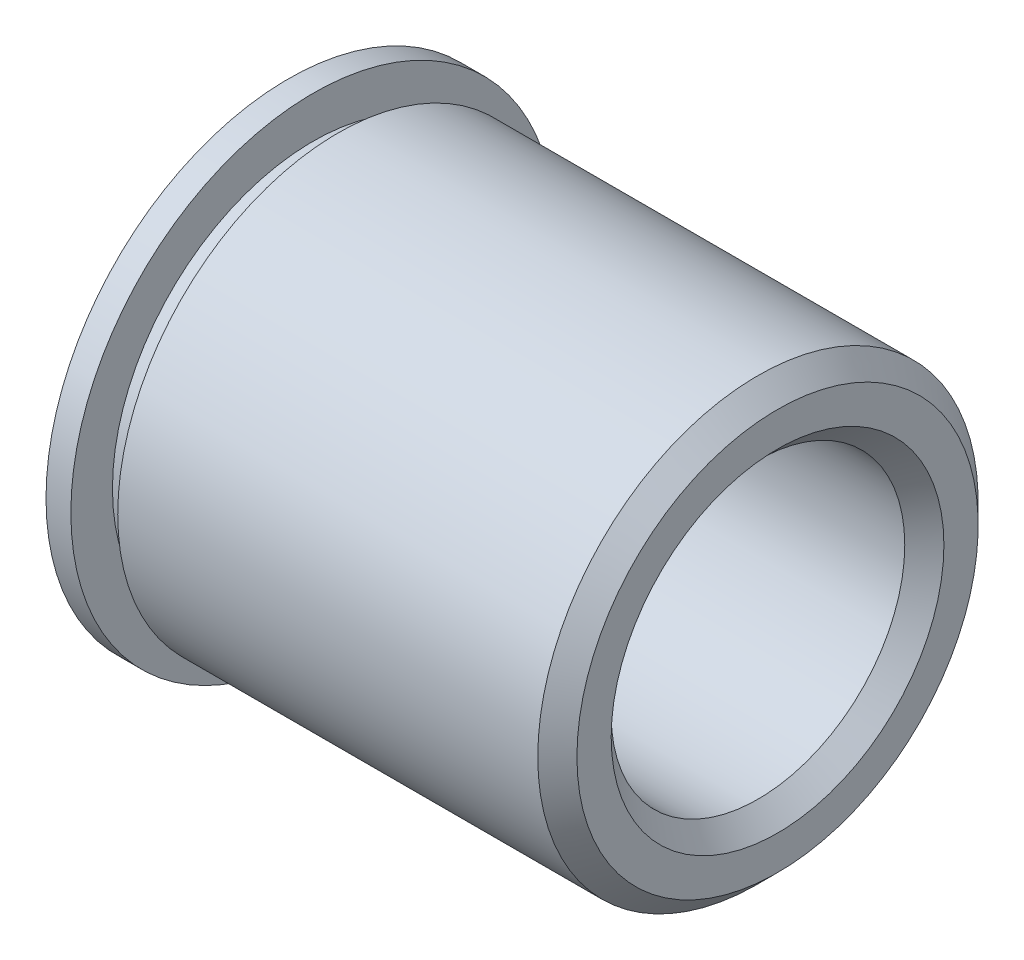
from build123d import *

# Parameters (mm, degrees)
SKETCH2_R          = 1.5
CUT_EXTRUDE1_DEPTH = 7.103380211
CHAMFER1_SIZE      = 0.2
CHAMFER2_SIZE      = 0.2


with BuildPart() as part:
    # Sketch1 → Revolve1 (revolve)
    with BuildSketch(Plane.XY, mode=Mode.PRIVATE) as revolve1_sk:
        Polygon((74.213672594, 0), (74.213672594, 2.25), (69.721672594, 2.25), (69.721672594, 2.05), (69.467672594, 2.05), (69.467672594, 2.475), (69.213672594, 2.475), (69.213672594, 0), align=None)
    revolve(revolve1_sk.sketch.rotate(Axis((-67.824902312, 0, 0), (1, 0, 0)), 90), axis=Axis((-67.824902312, 0, 0), (1, 0, 0)))

    # Sketch2 → Cut-Extrude1 (cut, through all)
    with BuildSketch(Plane(origin=(74.213672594, 0, 0), x_dir=(0, 0, -1), z_dir=(1, 0, 0))):
        Circle(SKETCH2_R)
    extrude(amount=-CUT_EXTRUDE1_DEPTH, mode=Mode.SUBTRACT)

    # Chamfer1
    chamfer1_edges = [part.edges().sort_by_distance(p)[0] for p in [
        (74.213672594, 0, -2.25),
    ]]
    chamfer(chamfer1_edges, length=CHAMFER1_SIZE)

    # Chamfer2
    chamfer2_edges = [part.edges().sort_by_distance(p)[0] for p in [
        (69.213672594, 0, 1.5),
        (74.213672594, 0, 1.5),
    ]]
    chamfer(chamfer2_edges, length=CHAMFER2_SIZE)


solid = part.part
